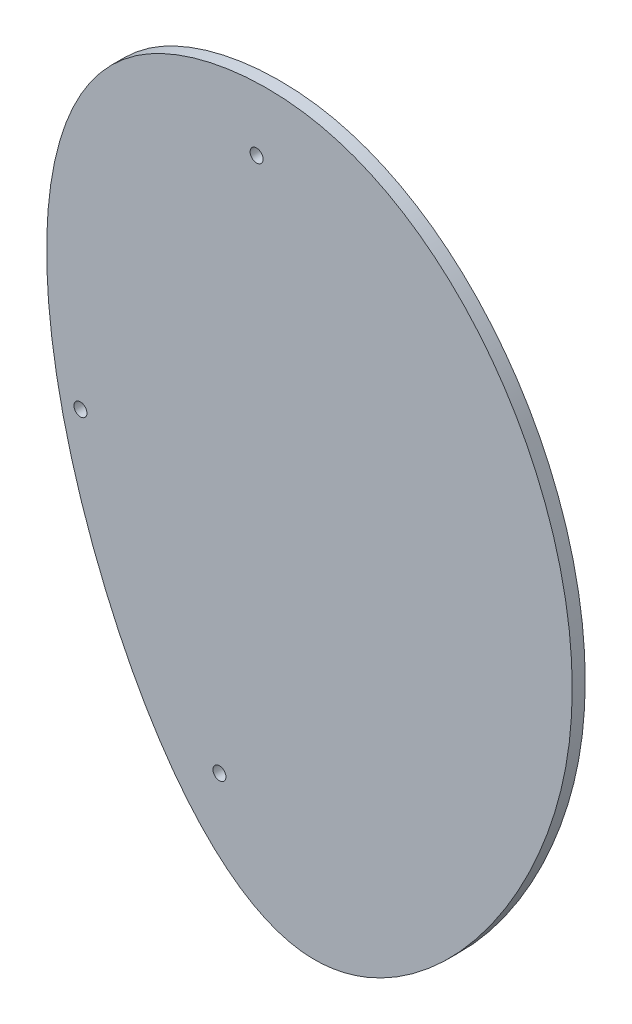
ISO-10303-21;
HEADER;
FILE_DESCRIPTION(('STEP AP214'),'2;1');
FILE_NAME('part.step','',(''),(''),'','','');
FILE_SCHEMA(('AUTOMOTIVE_DESIGN { 1 0 10303 214 1 1 1 1 }'));
ENDSEC;
DATA;
#1=APPLICATION_CONTEXT('core data for automotive mechanical design processes');
#2=APPLICATION_PROTOCOL_DEFINITION('international standard','automotive_design',2000,#1);
#3=PRODUCT_CONTEXT('',#1,'mechanical');
#4=PRODUCT('Part','Part','',(#3));
#5=PRODUCT_RELATED_PRODUCT_CATEGORY('part','',(#4));
#6=PRODUCT_DEFINITION_FORMATION('','',#4);
#7=PRODUCT_DEFINITION_CONTEXT('part definition',#1,'design');
#8=PRODUCT_DEFINITION('design','',#6,#7);
#9=PRODUCT_DEFINITION_SHAPE('','',#8);
#10=(LENGTH_UNIT() NAMED_UNIT(*) SI_UNIT(.MILLI.,.METRE.));
#11=(NAMED_UNIT(*) PLANE_ANGLE_UNIT() SI_UNIT($,.RADIAN.));
#12=(NAMED_UNIT(*) SI_UNIT($,.STERADIAN.) SOLID_ANGLE_UNIT());
#13=UNCERTAINTY_MEASURE_WITH_UNIT(LENGTH_MEASURE(1.E-05),#10,'distance_accuracy_value','');
#14=(GEOMETRIC_REPRESENTATION_CONTEXT(3) GLOBAL_UNCERTAINTY_ASSIGNED_CONTEXT((#13)) GLOBAL_UNIT_ASSIGNED_CONTEXT((#10,
#11,#12)) REPRESENTATION_CONTEXT('',''));
#15=CARTESIAN_POINT('',(0.,0.,0.));
#16=DIRECTION('',(0.,0.,1.));
#17=DIRECTION('',(1.,0.,0.));
#18=AXIS2_PLACEMENT_3D('',#15,#16,#17);
#19=CARTESIAN_POINT('',(-4.01156327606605,0.674376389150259,3.175));
#20=DIRECTION('',(0.,0.,-1.));
#21=DIRECTION('',(-1.,0.,0.));
#22=AXIS2_PLACEMENT_3D('',#19,#20,#21);
#23=PLANE('',#22);
#24=CARTESIAN_POINT('',(0.,177.8,3.175));
#25=CARTESIAN_POINT('',(-13.4717536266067,179.793441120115,3.175));
#26=CARTESIAN_POINT('',(-71.3531500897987,169.650700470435,3.175));
#27=CARTESIAN_POINT('',(-65.7974672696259,65.9003241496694,3.175));
#28=CARTESIAN_POINT('',(2.51939413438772,-30.2221295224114,3.175));
#29=CARTESIAN_POINT('',(96.5839832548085,80.2189876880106,3.175));
#30=CARTESIAN_POINT('',(42.4900331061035,171.512668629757,3.175));
#31=CARTESIAN_POINT('',(0.,177.8,3.175));
#32=B_SPLINE_CURVE_WITH_KNOTS('',3,(#24,#25,#26,#27,#28,#29,#30,#31),.UNSPECIFIED.,.T.,.F.,(4,1,
1,1,1,4),(0.,0.0877803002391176,0.346466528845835,0.51093075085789,0.72314013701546,1.),.UNSPECIFIED.);
#33=CARTESIAN_POINT('',(0.,177.8,3.175));
#34=VERTEX_POINT('',#33);
#35=EDGE_CURVE('E10',#34,#34,#32,.T.);
#36=ORIENTED_EDGE('',*,*,#35,.T.);
#37=EDGE_LOOP('',(#36));
#38=FACE_BOUND('',#37,.T.);
#39=CARTESIAN_POINT('',(-11.6073799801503,162.962327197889,3.175));
#40=DIRECTION('',(0.,0.,1.));
#41=DIRECTION('',(1.,0.,0.));
#42=AXIS2_PLACEMENT_3D('',#39,#40,#41);
#43=CIRCLE('',#42,1.5875);
#44=CARTESIAN_POINT('',(-10.0198799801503,162.962327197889,3.175));
#45=VERTEX_POINT('',#44);
#46=EDGE_CURVE('E54',#45,#45,#43,.T.);
#47=ORIENTED_EDGE('',*,*,#46,.F.);
#48=EDGE_LOOP('',(#47));
#49=FACE_BOUND('',#48,.T.);
#50=CARTESIAN_POINT('',(-20.6862499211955,27.7184715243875,3.175));
#51=DIRECTION('',(0.,0.,1.));
#52=DIRECTION('',(1.,0.,0.));
#53=AXIS2_PLACEMENT_3D('',#50,#51,#52);
#54=CIRCLE('',#53,1.5875);
#55=CARTESIAN_POINT('',(-19.0987499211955,27.7184715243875,3.175));
#56=VERTEX_POINT('',#55);
#57=EDGE_CURVE('E66',#56,#56,#54,.T.);
#58=ORIENTED_EDGE('',*,*,#57,.F.);
#59=EDGE_LOOP('',(#58));
#60=FACE_BOUND('',#59,.T.);
#61=CARTESIAN_POINT('',(-54.6473916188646,87.7259679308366,3.175));
#62=DIRECTION('',(0.,0.,1.));
#63=DIRECTION('',(1.,0.,0.));
#64=AXIS2_PLACEMENT_3D('',#61,#62,#63);
#65=CIRCLE('',#64,1.5875);
#66=CARTESIAN_POINT('',(-53.0598916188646,87.7259679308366,3.175));
#67=VERTEX_POINT('',#66);
#68=EDGE_CURVE('E74',#67,#67,#65,.T.);
#69=ORIENTED_EDGE('',*,*,#68,.F.);
#70=EDGE_LOOP('',(#69));
#71=FACE_BOUND('',#70,.T.);
#72=ADVANCED_FACE('F39',(#38,#49,#60,#71),#23,.F.);
#73=CARTESIAN_POINT('',(-4.01156327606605,0.674376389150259,0.));
#74=DIRECTION('',(0.,0.,-1.));
#75=DIRECTION('',(-1.,0.,0.));
#76=AXIS2_PLACEMENT_3D('',#73,#74,#75);
#77=PLANE('',#76);
#78=CARTESIAN_POINT('',(-20.6862499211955,27.7184715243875,0.));
#79=DIRECTION('',(0.,0.,1.));
#80=DIRECTION('',(1.,0.,0.));
#81=AXIS2_PLACEMENT_3D('',#78,#79,#80);
#82=CIRCLE('',#81,1.5875);
#83=CARTESIAN_POINT('',(-19.0987499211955,27.7184715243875,0.));
#84=VERTEX_POINT('',#83);
#85=EDGE_CURVE('E70',#84,#84,#82,.T.);
#86=ORIENTED_EDGE('',*,*,#85,.T.);
#87=EDGE_LOOP('',(#86));
#88=FACE_BOUND('',#87,.T.);
#89=CARTESIAN_POINT('',(0.,177.8,0.));
#90=CARTESIAN_POINT('',(-13.4717536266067,179.793441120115,0.));
#91=CARTESIAN_POINT('',(-71.3531500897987,169.650700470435,0.));
#92=CARTESIAN_POINT('',(-65.7974672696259,65.9003241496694,0.));
#93=CARTESIAN_POINT('',(2.51939413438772,-30.2221295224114,0.));
#94=CARTESIAN_POINT('',(96.5839832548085,80.2189876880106,0.));
#95=CARTESIAN_POINT('',(42.4900331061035,171.512668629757,0.));
#96=CARTESIAN_POINT('',(0.,177.8,0.));
#97=B_SPLINE_CURVE_WITH_KNOTS('',3,(#89,#90,#91,#92,#93,#94,#95,#96),.UNSPECIFIED.,.T.,.F.,(4,1,
1,1,1,4),(0.,0.0877803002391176,0.346466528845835,0.51093075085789,0.72314013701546,1.),.UNSPECIFIED.);
#98=CARTESIAN_POINT('',(0.,177.8,0.));
#99=VERTEX_POINT('',#98);
#100=EDGE_CURVE('E44',#99,#99,#97,.T.);
#101=ORIENTED_EDGE('',*,*,#100,.F.);
#102=EDGE_LOOP('',(#101));
#103=FACE_BOUND('',#102,.T.);
#104=CARTESIAN_POINT('',(-11.6073799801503,162.962327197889,0.));
#105=DIRECTION('',(0.,0.,1.));
#106=DIRECTION('',(1.,0.,0.));
#107=AXIS2_PLACEMENT_3D('',#104,#105,#106);
#108=CIRCLE('',#107,1.5875);
#109=CARTESIAN_POINT('',(-10.0198799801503,162.962327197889,0.));
#110=VERTEX_POINT('',#109);
#111=EDGE_CURVE('E59',#110,#110,#108,.T.);
#112=ORIENTED_EDGE('',*,*,#111,.T.);
#113=EDGE_LOOP('',(#112));
#114=FACE_BOUND('',#113,.T.);
#115=CARTESIAN_POINT('',(-54.6473916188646,87.7259679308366,0.));
#116=DIRECTION('',(0.,0.,1.));
#117=DIRECTION('',(1.,0.,0.));
#118=AXIS2_PLACEMENT_3D('',#115,#116,#117);
#119=CIRCLE('',#118,1.5875);
#120=CARTESIAN_POINT('',(-53.0598916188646,87.7259679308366,0.));
#121=VERTEX_POINT('',#120);
#122=EDGE_CURVE('E78',#121,#121,#119,.T.);
#123=ORIENTED_EDGE('',*,*,#122,.T.);
#124=EDGE_LOOP('',(#123));
#125=FACE_BOUND('',#124,.T.);
#126=ADVANCED_FACE('F91',(#88,#103,#114,#125),#77,.T.);
#127=DIRECTION('',(0.,0.,-1.));
#128=VECTOR('',#127,1.);
#129=SURFACE_OF_LINEAR_EXTRUSION('',#32,#128);
#130=ORIENTED_EDGE('',*,*,#35,.F.);
#131=EDGE_LOOP('',(#130));
#132=FACE_BOUND('',#131,.T.);
#133=ORIENTED_EDGE('',*,*,#100,.T.);
#134=EDGE_LOOP('',(#133));
#135=FACE_BOUND('',#134,.T.);
#136=ADVANCED_FACE('F41',(#132,#135),#129,.F.);
#137=CARTESIAN_POINT('',(-11.6073799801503,162.962327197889,3.175));
#138=DIRECTION('',(0.,0.,-1.));
#139=DIRECTION('',(-1.,0.,0.));
#140=AXIS2_PLACEMENT_3D('',#137,#138,#139);
#141=CYLINDRICAL_SURFACE('',#140,1.5875);
#142=ORIENTED_EDGE('',*,*,#46,.T.);
#143=EDGE_LOOP('',(#142));
#144=FACE_BOUND('',#143,.T.);
#145=ORIENTED_EDGE('',*,*,#111,.F.);
#146=EDGE_LOOP('',(#145));
#147=FACE_BOUND('',#146,.T.);
#148=ADVANCED_FACE('F99',(#144,#147),#141,.F.);
#149=CARTESIAN_POINT('',(-20.6862499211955,27.7184715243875,3.175));
#150=DIRECTION('',(0.,0.,-1.));
#151=DIRECTION('',(-1.,0.,0.));
#152=AXIS2_PLACEMENT_3D('',#149,#150,#151);
#153=CYLINDRICAL_SURFACE('',#152,1.5875);
#154=ORIENTED_EDGE('',*,*,#57,.T.);
#155=EDGE_LOOP('',(#154));
#156=FACE_BOUND('',#155,.T.);
#157=ORIENTED_EDGE('',*,*,#85,.F.);
#158=EDGE_LOOP('',(#157));
#159=FACE_BOUND('',#158,.T.);
#160=ADVANCED_FACE('F102',(#156,#159),#153,.F.);
#161=CARTESIAN_POINT('',(-54.6473916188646,87.7259679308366,3.175));
#162=DIRECTION('',(0.,0.,-1.));
#163=DIRECTION('',(-1.,0.,0.));
#164=AXIS2_PLACEMENT_3D('',#161,#162,#163);
#165=CYLINDRICAL_SURFACE('',#164,1.5875);
#166=ORIENTED_EDGE('',*,*,#68,.T.);
#167=EDGE_LOOP('',(#166));
#168=FACE_BOUND('',#167,.T.);
#169=ORIENTED_EDGE('',*,*,#122,.F.);
#170=EDGE_LOOP('',(#169));
#171=FACE_BOUND('',#170,.T.);
#172=ADVANCED_FACE('F87',(#168,#171),#165,.F.);
#173=CLOSED_SHELL('',(#72,#126,#136,#148,#160,#172));
#174=MANIFOLD_SOLID_BREP('B2',#173);
#175=ADVANCED_BREP_SHAPE_REPRESENTATION('',(#18,#174),#14);
#176=SHAPE_DEFINITION_REPRESENTATION(#9,#175);
ENDSEC;
END-ISO-10303-21;
